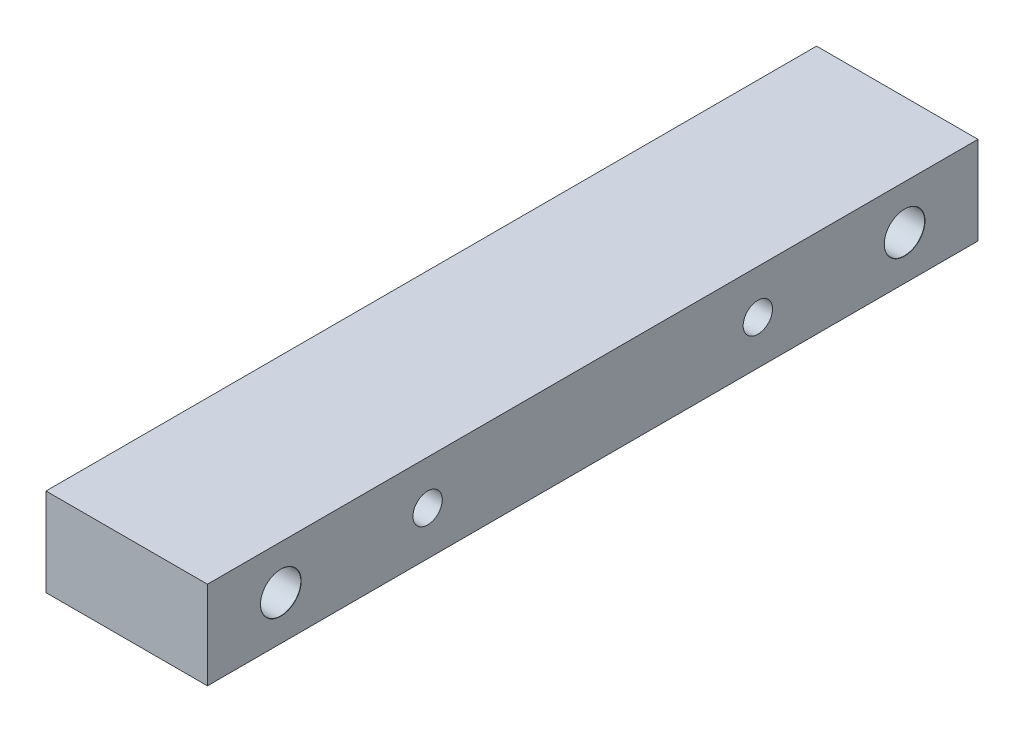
ISO-10303-21;
HEADER;
FILE_DESCRIPTION(('STEP AP214'),'2;1');
FILE_NAME('part.step','',(''),(''),'','','');
FILE_SCHEMA(('AUTOMOTIVE_DESIGN { 1 0 10303 214 1 1 1 1 }'));
ENDSEC;
DATA;
#1=APPLICATION_CONTEXT('core data for automotive mechanical design processes');
#2=APPLICATION_PROTOCOL_DEFINITION('international standard','automotive_design',2000,#1);
#3=PRODUCT_CONTEXT('',#1,'mechanical');
#4=PRODUCT('Part','Part','',(#3));
#5=PRODUCT_RELATED_PRODUCT_CATEGORY('part','',(#4));
#6=PRODUCT_DEFINITION_FORMATION('','',#4);
#7=PRODUCT_DEFINITION_CONTEXT('part definition',#1,'design');
#8=PRODUCT_DEFINITION('design','',#6,#7);
#9=PRODUCT_DEFINITION_SHAPE('','',#8);
#10=(LENGTH_UNIT() NAMED_UNIT(*) SI_UNIT(.MILLI.,.METRE.));
#11=(NAMED_UNIT(*) PLANE_ANGLE_UNIT() SI_UNIT($,.RADIAN.));
#12=(NAMED_UNIT(*) SI_UNIT($,.STERADIAN.) SOLID_ANGLE_UNIT());
#13=UNCERTAINTY_MEASURE_WITH_UNIT(LENGTH_MEASURE(1.E-05),#10,'distance_accuracy_value','');
#14=(GEOMETRIC_REPRESENTATION_CONTEXT(3) GLOBAL_UNCERTAINTY_ASSIGNED_CONTEXT((#13)) GLOBAL_UNIT_ASSIGNED_CONTEXT((#10,
#11,#12)) REPRESENTATION_CONTEXT('',''));
#15=CARTESIAN_POINT('',(0.,0.,0.));
#16=DIRECTION('',(0.,0.,1.));
#17=DIRECTION('',(1.,0.,0.));
#18=AXIS2_PLACEMENT_3D('',#15,#16,#17);
#19=CARTESIAN_POINT('',(-10.,-46.8874741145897,-105.));
#20=DIRECTION('',(1.,0.,0.));
#21=DIRECTION('',(0.,0.,-1.));
#22=AXIS2_PLACEMENT_3D('',#19,#20,#21);
#23=PLANE('',#22);
#24=CARTESIAN_POINT('',(-10.,-40.8874741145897,-30.));
#25=DIRECTION('',(-1.,0.,0.));
#26=DIRECTION('',(0.,0.,1.));
#27=AXIS2_PLACEMENT_3D('',#24,#25,#26);
#28=CIRCLE('',#27,2.);
#29=CARTESIAN_POINT('',(-10.,-40.8874741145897,-28.));
#30=VERTEX_POINT('',#29);
#31=EDGE_CURVE('E177',#30,#30,#28,.T.);
#32=ORIENTED_EDGE('',*,*,#31,.T.);
#33=EDGE_LOOP('',(#32));
#34=FACE_BOUND('',#33,.T.);
#35=CARTESIAN_POINT('',(-10.,-40.8874741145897,-75.));
#36=DIRECTION('',(-1.,0.,0.));
#37=DIRECTION('',(0.,0.,1.));
#38=AXIS2_PLACEMENT_3D('',#35,#36,#37);
#39=CIRCLE('',#38,2.);
#40=CARTESIAN_POINT('',(-10.,-40.8874741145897,-73.));
#41=VERTEX_POINT('',#40);
#42=EDGE_CURVE('E187',#41,#41,#39,.T.);
#43=ORIENTED_EDGE('',*,*,#42,.T.);
#44=EDGE_LOOP('',(#43));
#45=FACE_BOUND('',#44,.T.);
#46=CARTESIAN_POINT('',(-10.,-40.8874741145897,-10.));
#47=DIRECTION('',(-1.,0.,0.));
#48=DIRECTION('',(0.,0.,1.));
#49=AXIS2_PLACEMENT_3D('',#46,#47,#48);
#50=CIRCLE('',#49,2.775);
#51=CARTESIAN_POINT('',(-10.,-40.8874741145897,-7.225));
#52=VERTEX_POINT('',#51);
#53=EDGE_CURVE('E190',#52,#52,#50,.T.);
#54=ORIENTED_EDGE('',*,*,#53,.T.);
#55=EDGE_LOOP('',(#54));
#56=FACE_BOUND('',#55,.T.);
#57=CARTESIAN_POINT('',(-10.,-40.8874741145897,-95.));
#58=DIRECTION('',(-1.,0.,0.));
#59=DIRECTION('',(0.,0.,1.));
#60=AXIS2_PLACEMENT_3D('',#57,#58,#59);
#61=CIRCLE('',#60,2.775);
#62=CARTESIAN_POINT('',(-10.,-40.8874741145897,-92.225));
#63=VERTEX_POINT('',#62);
#64=EDGE_CURVE('E211',#63,#63,#61,.T.);
#65=ORIENTED_EDGE('',*,*,#64,.T.);
#66=EDGE_LOOP('',(#65));
#67=FACE_BOUND('',#66,.T.);
#68=DIRECTION('',(0.,1.,0.));
#69=VECTOR('',#68,1.);
#70=CARTESIAN_POINT('',(-10.,-46.8874741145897,0.));
#71=LINE('',#70,#69);
#72=CARTESIAN_POINT('',(-10.,-46.8874741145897,0.));
#73=VERTEX_POINT('',#72);
#74=CARTESIAN_POINT('',(-10.,-34.8874741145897,0.));
#75=VERTEX_POINT('',#74);
#76=EDGE_CURVE('E81',#73,#75,#71,.T.);
#77=ORIENTED_EDGE('',*,*,#76,.F.);
#78=DIRECTION('',(0.,0.,1.));
#79=VECTOR('',#78,1.);
#80=CARTESIAN_POINT('',(-10.,-46.8874741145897,-105.));
#81=LINE('',#80,#79);
#82=CARTESIAN_POINT('',(-10.,-46.8874741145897,-105.));
#83=VERTEX_POINT('',#82);
#84=EDGE_CURVE('E11',#83,#73,#81,.T.);
#85=ORIENTED_EDGE('',*,*,#84,.F.);
#86=DIRECTION('',(0.,1.,0.));
#87=VECTOR('',#86,1.);
#88=CARTESIAN_POINT('',(-10.,-46.8874741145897,-105.));
#89=LINE('',#88,#87);
#90=CARTESIAN_POINT('',(-10.,-34.8874741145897,-105.));
#91=VERTEX_POINT('',#90);
#92=EDGE_CURVE('E74',#83,#91,#89,.T.);
#93=ORIENTED_EDGE('',*,*,#92,.T.);
#94=DIRECTION('',(0.,0.,1.));
#95=VECTOR('',#94,1.);
#96=CARTESIAN_POINT('',(-10.,-34.8874741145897,-105.));
#97=LINE('',#96,#95);
#98=EDGE_CURVE('E19',#91,#75,#97,.T.);
#99=ORIENTED_EDGE('',*,*,#98,.T.);
#100=EDGE_LOOP('',(#77,#85,#93,#99));
#101=FACE_BOUND('',#100,.T.);
#102=ADVANCED_FACE('F16',(#34,#45,#56,#67,#101),#23,.T.);
#103=CARTESIAN_POINT('',(-10.,-46.8874741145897,-105.));
#104=DIRECTION('',(0.,-1.,0.));
#105=DIRECTION('',(0.,0.,-1.));
#106=AXIS2_PLACEMENT_3D('',#103,#104,#105);
#107=PLANE('',#106);
#108=DIRECTION('',(1.,0.,0.));
#109=VECTOR('',#108,1.);
#110=CARTESIAN_POINT('',(-10.,-46.8874741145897,0.));
#111=LINE('',#110,#109);
#112=CARTESIAN_POINT('',(-32.,-46.8874741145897,0.));
#113=VERTEX_POINT('',#112);
#114=EDGE_CURVE('E76',#113,#73,#111,.T.);
#115=ORIENTED_EDGE('',*,*,#114,.F.);
#116=DIRECTION('',(0.,0.,1.));
#117=VECTOR('',#116,1.);
#118=CARTESIAN_POINT('',(-32.,-46.8874741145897,-105.));
#119=LINE('',#118,#117);
#120=CARTESIAN_POINT('',(-32.,-46.8874741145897,-105.));
#121=VERTEX_POINT('',#120);
#122=EDGE_CURVE('E25',#121,#113,#119,.T.);
#123=ORIENTED_EDGE('',*,*,#122,.F.);
#124=DIRECTION('',(1.,0.,0.));
#125=VECTOR('',#124,1.);
#126=CARTESIAN_POINT('',(-10.,-46.8874741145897,-105.));
#127=LINE('',#126,#125);
#128=EDGE_CURVE('E71',#121,#83,#127,.T.);
#129=ORIENTED_EDGE('',*,*,#128,.T.);
#130=ORIENTED_EDGE('',*,*,#84,.T.);
#131=EDGE_LOOP('',(#115,#123,#129,#130));
#132=FACE_BOUND('',#131,.T.);
#133=ADVANCED_FACE('F92',(#132),#107,.T.);
#134=CARTESIAN_POINT('',(-32.,-46.8874741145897,-105.));
#135=DIRECTION('',(-1.,0.,0.));
#136=DIRECTION('',(0.,0.,1.));
#137=AXIS2_PLACEMENT_3D('',#134,#135,#136);
#138=PLANE('',#137);
#139=CARTESIAN_POINT('',(-32.,-40.8874741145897,-30.));
#140=DIRECTION('',(-1.,0.,0.));
#141=DIRECTION('',(0.,0.,1.));
#142=AXIS2_PLACEMENT_3D('',#139,#140,#141);
#143=CIRCLE('',#142,2.);
#144=CARTESIAN_POINT('',(-32.,-40.8874741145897,-28.));
#145=VERTEX_POINT('',#144);
#146=EDGE_CURVE('E180',#145,#145,#143,.T.);
#147=ORIENTED_EDGE('',*,*,#146,.F.);
#148=EDGE_LOOP('',(#147));
#149=FACE_BOUND('',#148,.T.);
#150=CARTESIAN_POINT('',(-32.,-40.8874741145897,-75.));
#151=DIRECTION('',(-1.,0.,0.));
#152=DIRECTION('',(0.,0.,1.));
#153=AXIS2_PLACEMENT_3D('',#150,#151,#152);
#154=CIRCLE('',#153,2.);
#155=CARTESIAN_POINT('',(-32.,-40.8874741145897,-73.));
#156=VERTEX_POINT('',#155);
#157=EDGE_CURVE('E182',#156,#156,#154,.T.);
#158=ORIENTED_EDGE('',*,*,#157,.F.);
#159=EDGE_LOOP('',(#158));
#160=FACE_BOUND('',#159,.T.);
#161=CARTESIAN_POINT('',(-32.,-40.8874741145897,-10.));
#162=DIRECTION('',(-1.,0.,0.));
#163=DIRECTION('',(0.,0.,1.));
#164=AXIS2_PLACEMENT_3D('',#161,#162,#163);
#165=CIRCLE('',#164,5.025);
#166=CARTESIAN_POINT('',(-32.,-40.8874741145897,-4.975));
#167=VERTEX_POINT('',#166);
#168=EDGE_CURVE('E193',#167,#167,#165,.T.);
#169=ORIENTED_EDGE('',*,*,#168,.F.);
#170=EDGE_LOOP('',(#169));
#171=FACE_BOUND('',#170,.T.);
#172=CARTESIAN_POINT('',(-32.,-40.8874741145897,-95.));
#173=DIRECTION('',(-1.,0.,0.));
#174=DIRECTION('',(0.,0.,1.));
#175=AXIS2_PLACEMENT_3D('',#172,#173,#174);
#176=CIRCLE('',#175,5.025);
#177=CARTESIAN_POINT('',(-32.,-40.8874741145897,-89.975));
#178=VERTEX_POINT('',#177);
#179=EDGE_CURVE('E214',#178,#178,#176,.T.);
#180=ORIENTED_EDGE('',*,*,#179,.F.);
#181=EDGE_LOOP('',(#180));
#182=FACE_BOUND('',#181,.T.);
#183=DIRECTION('',(0.,-1.,0.));
#184=VECTOR('',#183,1.);
#185=CARTESIAN_POINT('',(-32.,-46.8874741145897,0.));
#186=LINE('',#185,#184);
#187=CARTESIAN_POINT('',(-32.,-34.8874741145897,0.));
#188=VERTEX_POINT('',#187);
#189=EDGE_CURVE('E66',#188,#113,#186,.T.);
#190=ORIENTED_EDGE('',*,*,#189,.F.);
#191=DIRECTION('',(0.,0.,1.));
#192=VECTOR('',#191,1.);
#193=CARTESIAN_POINT('',(-32.,-34.8874741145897,-105.));
#194=LINE('',#193,#192);
#195=CARTESIAN_POINT('',(-32.,-34.8874741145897,-105.));
#196=VERTEX_POINT('',#195);
#197=EDGE_CURVE('E61',#196,#188,#194,.T.);
#198=ORIENTED_EDGE('',*,*,#197,.F.);
#199=DIRECTION('',(0.,-1.,0.));
#200=VECTOR('',#199,1.);
#201=CARTESIAN_POINT('',(-32.,-46.8874741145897,-105.));
#202=LINE('',#201,#200);
#203=EDGE_CURVE('E64',#196,#121,#202,.T.);
#204=ORIENTED_EDGE('',*,*,#203,.T.);
#205=ORIENTED_EDGE('',*,*,#122,.T.);
#206=EDGE_LOOP('',(#190,#198,#204,#205));
#207=FACE_BOUND('',#206,.T.);
#208=ADVANCED_FACE('F63',(#149,#160,#171,#182,#207),#138,.T.);
#209=CARTESIAN_POINT('',(-10.,-34.8874741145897,-105.));
#210=DIRECTION('',(0.,1.,0.));
#211=DIRECTION('',(0.,0.,1.));
#212=AXIS2_PLACEMENT_3D('',#209,#210,#211);
#213=PLANE('',#212);
#214=DIRECTION('',(-1.,0.,0.));
#215=VECTOR('',#214,1.);
#216=CARTESIAN_POINT('',(-10.,-34.8874741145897,0.));
#217=LINE('',#216,#215);
#218=EDGE_CURVE('E84',#75,#188,#217,.T.);
#219=ORIENTED_EDGE('',*,*,#218,.F.);
#220=ORIENTED_EDGE('',*,*,#98,.F.);
#221=DIRECTION('',(-1.,0.,0.));
#222=VECTOR('',#221,1.);
#223=CARTESIAN_POINT('',(-10.,-34.8874741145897,-105.));
#224=LINE('',#223,#222);
#225=EDGE_CURVE('E70',#91,#196,#224,.T.);
#226=ORIENTED_EDGE('',*,*,#225,.T.);
#227=ORIENTED_EDGE('',*,*,#197,.T.);
#228=EDGE_LOOP('',(#219,#220,#226,#227));
#229=FACE_BOUND('',#228,.T.);
#230=ADVANCED_FACE('F73',(#229),#213,.T.);
#231=CARTESIAN_POINT('',(0.,0.,-105.));
#232=DIRECTION('',(0.,0.,1.));
#233=DIRECTION('',(1.,0.,0.));
#234=AXIS2_PLACEMENT_3D('',#231,#232,#233);
#235=PLANE('',#234);
#236=ORIENTED_EDGE('',*,*,#92,.F.);
#237=ORIENTED_EDGE('',*,*,#128,.F.);
#238=ORIENTED_EDGE('',*,*,#203,.F.);
#239=ORIENTED_EDGE('',*,*,#225,.F.);
#240=EDGE_LOOP('',(#236,#237,#238,#239));
#241=FACE_BOUND('',#240,.T.);
#242=ADVANCED_FACE('F69',(#241),#235,.F.);
#243=CARTESIAN_POINT('',(0.,0.,0.));
#244=DIRECTION('',(0.,0.,1.));
#245=DIRECTION('',(1.,0.,0.));
#246=AXIS2_PLACEMENT_3D('',#243,#244,#245);
#247=PLANE('',#246);
#248=ORIENTED_EDGE('',*,*,#76,.T.);
#249=ORIENTED_EDGE('',*,*,#218,.T.);
#250=ORIENTED_EDGE('',*,*,#189,.T.);
#251=ORIENTED_EDGE('',*,*,#114,.T.);
#252=EDGE_LOOP('',(#248,#249,#250,#251));
#253=FACE_BOUND('',#252,.T.);
#254=ADVANCED_FACE('F91',(#253),#247,.T.);
#255=CARTESIAN_POINT('',(-10.025,-40.8874741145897,-95.));
#256=DIRECTION('',(1.,0.,0.));
#257=DIRECTION('',(0.,0.,-1.));
#258=AXIS2_PLACEMENT_3D('',#255,#256,#257);
#259=CONICAL_SURFACE('',#258,2.75,0.785398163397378);
#260=ORIENTED_EDGE('',*,*,#64,.F.);
#261=EDGE_LOOP('',(#260));
#262=FACE_BOUND('',#261,.T.);
#263=CARTESIAN_POINT('',(-10.025,-40.8874741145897,-95.));
#264=DIRECTION('',(-1.,0.,0.));
#265=DIRECTION('',(0.,0.,1.));
#266=AXIS2_PLACEMENT_3D('',#263,#264,#265);
#267=CIRCLE('',#266,2.75);
#268=CARTESIAN_POINT('',(-10.025,-40.8874741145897,-92.25));
#269=VERTEX_POINT('',#268);
#270=EDGE_CURVE('E85',#269,#269,#267,.T.);
#271=ORIENTED_EDGE('',*,*,#270,.T.);
#272=EDGE_LOOP('',(#271));
#273=FACE_BOUND('',#272,.T.);
#274=ADVANCED_FACE('F115',(#262,#273),#259,.F.);
#275=CARTESIAN_POINT('',(-32.,-40.8874741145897,-95.));
#276=DIRECTION('',(-1.,0.,0.));
#277=DIRECTION('',(0.,0.,1.));
#278=AXIS2_PLACEMENT_3D('',#275,#276,#277);
#279=CYLINDRICAL_SURFACE('',#278,2.75);
#280=ORIENTED_EDGE('',*,*,#270,.F.);
#281=EDGE_LOOP('',(#280));
#282=FACE_BOUND('',#281,.T.);
#283=CARTESIAN_POINT('',(-26.275,-40.8874741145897,-95.));
#284=DIRECTION('',(-1.,0.,0.));
#285=DIRECTION('',(0.,0.,1.));
#286=AXIS2_PLACEMENT_3D('',#283,#284,#285);
#287=CIRCLE('',#286,2.75);
#288=CARTESIAN_POINT('',(-26.275,-40.8874741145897,-92.25));
#289=VERTEX_POINT('',#288);
#290=EDGE_CURVE('E226',#289,#289,#287,.T.);
#291=ORIENTED_EDGE('',*,*,#290,.T.);
#292=EDGE_LOOP('',(#291));
#293=FACE_BOUND('',#292,.T.);
#294=ADVANCED_FACE('F119',(#282,#293),#279,.F.);
#295=CARTESIAN_POINT('',(-26.3,-40.8874741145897,-95.));
#296=DIRECTION('',(-1.,0.,0.));
#297=DIRECTION('',(0.,0.,1.));
#298=AXIS2_PLACEMENT_3D('',#295,#296,#297);
#299=CONICAL_SURFACE('',#298,2.775,0.785398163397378);
#300=ORIENTED_EDGE('',*,*,#290,.F.);
#301=EDGE_LOOP('',(#300));
#302=FACE_BOUND('',#301,.T.);
#303=CARTESIAN_POINT('',(-26.3,-40.8874741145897,-95.));
#304=DIRECTION('',(-1.,0.,0.));
#305=DIRECTION('',(0.,0.,1.));
#306=AXIS2_PLACEMENT_3D('',#303,#304,#305);
#307=CIRCLE('',#306,2.775);
#308=CARTESIAN_POINT('',(-26.3,-40.8874741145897,-92.225));
#309=VERTEX_POINT('',#308);
#310=EDGE_CURVE('E223',#309,#309,#307,.T.);
#311=ORIENTED_EDGE('',*,*,#310,.T.);
#312=EDGE_LOOP('',(#311));
#313=FACE_BOUND('',#312,.T.);
#314=ADVANCED_FACE('F123',(#302,#313),#299,.F.);
#315=CARTESIAN_POINT('',(-26.3,-38.1124741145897,-95.));
#316=DIRECTION('',(1.,0.,0.));
#317=DIRECTION('',(0.,0.,-1.));
#318=AXIS2_PLACEMENT_3D('',#315,#316,#317);
#319=PLANE('',#318);
#320=ORIENTED_EDGE('',*,*,#310,.F.);
#321=EDGE_LOOP('',(#320));
#322=FACE_BOUND('',#321,.T.);
#323=CARTESIAN_POINT('',(-26.3,-40.8874741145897,-95.));
#324=DIRECTION('',(-1.,0.,0.));
#325=DIRECTION('',(0.,0.,1.));
#326=AXIS2_PLACEMENT_3D('',#323,#324,#325);
#327=CIRCLE('',#326,5.);
#328=CARTESIAN_POINT('',(-26.3,-40.8874741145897,-90.));
#329=VERTEX_POINT('',#328);
#330=EDGE_CURVE('E220',#329,#329,#327,.T.);
#331=ORIENTED_EDGE('',*,*,#330,.T.);
#332=EDGE_LOOP('',(#331));
#333=FACE_BOUND('',#332,.T.);
#334=ADVANCED_FACE('F127',(#322,#333),#319,.F.);
#335=CARTESIAN_POINT('',(-32.,-40.8874741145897,-95.));
#336=DIRECTION('',(-1.,0.,0.));
#337=DIRECTION('',(0.,0.,1.));
#338=AXIS2_PLACEMENT_3D('',#335,#336,#337);
#339=CYLINDRICAL_SURFACE('',#338,5.);
#340=ORIENTED_EDGE('',*,*,#330,.F.);
#341=EDGE_LOOP('',(#340));
#342=FACE_BOUND('',#341,.T.);
#343=CARTESIAN_POINT('',(-31.975,-40.8874741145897,-95.));
#344=DIRECTION('',(-1.,0.,0.));
#345=DIRECTION('',(0.,0.,1.));
#346=AXIS2_PLACEMENT_3D('',#343,#344,#345);
#347=CIRCLE('',#346,5.);
#348=CARTESIAN_POINT('',(-31.975,-40.8874741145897,-90.));
#349=VERTEX_POINT('',#348);
#350=EDGE_CURVE('E217',#349,#349,#347,.T.);
#351=ORIENTED_EDGE('',*,*,#350,.T.);
#352=EDGE_LOOP('',(#351));
#353=FACE_BOUND('',#352,.T.);
#354=ADVANCED_FACE('F131',(#342,#353),#339,.F.);
#355=CARTESIAN_POINT('',(-32.,-40.8874741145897,-95.));
#356=DIRECTION('',(-1.,0.,0.));
#357=DIRECTION('',(0.,0.,1.));
#358=AXIS2_PLACEMENT_3D('',#355,#356,#357);
#359=CONICAL_SURFACE('',#358,5.025,0.785398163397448);
#360=ORIENTED_EDGE('',*,*,#350,.F.);
#361=EDGE_LOOP('',(#360));
#362=FACE_BOUND('',#361,.T.);
#363=ORIENTED_EDGE('',*,*,#179,.T.);
#364=EDGE_LOOP('',(#363));
#365=FACE_BOUND('',#364,.T.);
#366=ADVANCED_FACE('F135',(#362,#365),#359,.F.);
#367=CARTESIAN_POINT('',(-10.025,-40.8874741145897,-10.));
#368=DIRECTION('',(1.,0.,0.));
#369=DIRECTION('',(0.,0.,-1.));
#370=AXIS2_PLACEMENT_3D('',#367,#368,#369);
#371=CONICAL_SURFACE('',#370,2.75,0.785398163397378);
#372=ORIENTED_EDGE('',*,*,#53,.F.);
#373=EDGE_LOOP('',(#372));
#374=FACE_BOUND('',#373,.T.);
#375=CARTESIAN_POINT('',(-10.025,-40.8874741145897,-10.));
#376=DIRECTION('',(-1.,0.,0.));
#377=DIRECTION('',(0.,0.,1.));
#378=AXIS2_PLACEMENT_3D('',#375,#376,#377);
#379=CIRCLE('',#378,2.75);
#380=CARTESIAN_POINT('',(-10.025,-40.8874741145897,-7.25));
#381=VERTEX_POINT('',#380);
#382=EDGE_CURVE('E208',#381,#381,#379,.T.);
#383=ORIENTED_EDGE('',*,*,#382,.T.);
#384=EDGE_LOOP('',(#383));
#385=FACE_BOUND('',#384,.T.);
#386=ADVANCED_FACE('F139',(#374,#385),#371,.F.);
#387=CARTESIAN_POINT('',(-32.,-40.8874741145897,-10.));
#388=DIRECTION('',(-1.,0.,0.));
#389=DIRECTION('',(0.,0.,1.));
#390=AXIS2_PLACEMENT_3D('',#387,#388,#389);
#391=CYLINDRICAL_SURFACE('',#390,2.75);
#392=ORIENTED_EDGE('',*,*,#382,.F.);
#393=EDGE_LOOP('',(#392));
#394=FACE_BOUND('',#393,.T.);
#395=CARTESIAN_POINT('',(-26.275,-40.8874741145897,-10.));
#396=DIRECTION('',(-1.,0.,0.));
#397=DIRECTION('',(0.,0.,1.));
#398=AXIS2_PLACEMENT_3D('',#395,#396,#397);
#399=CIRCLE('',#398,2.75);
#400=CARTESIAN_POINT('',(-26.275,-40.8874741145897,-7.25));
#401=VERTEX_POINT('',#400);
#402=EDGE_CURVE('E205',#401,#401,#399,.T.);
#403=ORIENTED_EDGE('',*,*,#402,.T.);
#404=EDGE_LOOP('',(#403));
#405=FACE_BOUND('',#404,.T.);
#406=ADVANCED_FACE('F143',(#394,#405),#391,.F.);
#407=CARTESIAN_POINT('',(-26.3,-40.8874741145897,-10.));
#408=DIRECTION('',(-1.,0.,0.));
#409=DIRECTION('',(0.,0.,1.));
#410=AXIS2_PLACEMENT_3D('',#407,#408,#409);
#411=CONICAL_SURFACE('',#410,2.775,0.785398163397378);
#412=ORIENTED_EDGE('',*,*,#402,.F.);
#413=EDGE_LOOP('',(#412));
#414=FACE_BOUND('',#413,.T.);
#415=CARTESIAN_POINT('',(-26.3,-40.8874741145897,-10.));
#416=DIRECTION('',(-1.,0.,0.));
#417=DIRECTION('',(0.,0.,1.));
#418=AXIS2_PLACEMENT_3D('',#415,#416,#417);
#419=CIRCLE('',#418,2.775);
#420=CARTESIAN_POINT('',(-26.3,-40.8874741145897,-7.225));
#421=VERTEX_POINT('',#420);
#422=EDGE_CURVE('E202',#421,#421,#419,.T.);
#423=ORIENTED_EDGE('',*,*,#422,.T.);
#424=EDGE_LOOP('',(#423));
#425=FACE_BOUND('',#424,.T.);
#426=ADVANCED_FACE('F147',(#414,#425),#411,.F.);
#427=CARTESIAN_POINT('',(-26.3,-38.1124741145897,-10.));
#428=DIRECTION('',(1.,0.,0.));
#429=DIRECTION('',(0.,0.,-1.));
#430=AXIS2_PLACEMENT_3D('',#427,#428,#429);
#431=PLANE('',#430);
#432=ORIENTED_EDGE('',*,*,#422,.F.);
#433=EDGE_LOOP('',(#432));
#434=FACE_BOUND('',#433,.T.);
#435=CARTESIAN_POINT('',(-26.3,-40.8874741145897,-10.));
#436=DIRECTION('',(-1.,0.,0.));
#437=DIRECTION('',(0.,0.,1.));
#438=AXIS2_PLACEMENT_3D('',#435,#436,#437);
#439=CIRCLE('',#438,5.);
#440=CARTESIAN_POINT('',(-26.3,-40.8874741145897,-5.));
#441=VERTEX_POINT('',#440);
#442=EDGE_CURVE('E199',#441,#441,#439,.T.);
#443=ORIENTED_EDGE('',*,*,#442,.T.);
#444=EDGE_LOOP('',(#443));
#445=FACE_BOUND('',#444,.T.);
#446=ADVANCED_FACE('F151',(#434,#445),#431,.F.);
#447=CARTESIAN_POINT('',(-32.,-40.8874741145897,-10.));
#448=DIRECTION('',(-1.,0.,0.));
#449=DIRECTION('',(0.,0.,1.));
#450=AXIS2_PLACEMENT_3D('',#447,#448,#449);
#451=CYLINDRICAL_SURFACE('',#450,5.);
#452=ORIENTED_EDGE('',*,*,#442,.F.);
#453=EDGE_LOOP('',(#452));
#454=FACE_BOUND('',#453,.T.);
#455=CARTESIAN_POINT('',(-31.975,-40.8874741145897,-10.));
#456=DIRECTION('',(-1.,0.,0.));
#457=DIRECTION('',(0.,0.,1.));
#458=AXIS2_PLACEMENT_3D('',#455,#456,#457);
#459=CIRCLE('',#458,5.);
#460=CARTESIAN_POINT('',(-31.975,-40.8874741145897,-5.));
#461=VERTEX_POINT('',#460);
#462=EDGE_CURVE('E196',#461,#461,#459,.T.);
#463=ORIENTED_EDGE('',*,*,#462,.T.);
#464=EDGE_LOOP('',(#463));
#465=FACE_BOUND('',#464,.T.);
#466=ADVANCED_FACE('F155',(#454,#465),#451,.F.);
#467=CARTESIAN_POINT('',(-32.,-40.8874741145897,-10.));
#468=DIRECTION('',(-1.,0.,0.));
#469=DIRECTION('',(0.,0.,1.));
#470=AXIS2_PLACEMENT_3D('',#467,#468,#469);
#471=CONICAL_SURFACE('',#470,5.025,0.785398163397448);
#472=ORIENTED_EDGE('',*,*,#462,.F.);
#473=EDGE_LOOP('',(#472));
#474=FACE_BOUND('',#473,.T.);
#475=ORIENTED_EDGE('',*,*,#168,.T.);
#476=EDGE_LOOP('',(#475));
#477=FACE_BOUND('',#476,.T.);
#478=ADVANCED_FACE('F159',(#474,#477),#471,.F.);
#479=CARTESIAN_POINT('',(-32.,-40.8874741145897,-75.));
#480=DIRECTION('',(-1.,0.,0.));
#481=DIRECTION('',(0.,0.,1.));
#482=AXIS2_PLACEMENT_3D('',#479,#480,#481);
#483=CYLINDRICAL_SURFACE('',#482,2.);
#484=ORIENTED_EDGE('',*,*,#42,.F.);
#485=EDGE_LOOP('',(#484));
#486=FACE_BOUND('',#485,.T.);
#487=ORIENTED_EDGE('',*,*,#157,.T.);
#488=EDGE_LOOP('',(#487));
#489=FACE_BOUND('',#488,.T.);
#490=ADVANCED_FACE('F163',(#486,#489),#483,.F.);
#491=CARTESIAN_POINT('',(-32.,-40.8874741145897,-30.));
#492=DIRECTION('',(-1.,0.,0.));
#493=DIRECTION('',(0.,0.,1.));
#494=AXIS2_PLACEMENT_3D('',#491,#492,#493);
#495=CYLINDRICAL_SURFACE('',#494,2.);
#496=ORIENTED_EDGE('',*,*,#31,.F.);
#497=EDGE_LOOP('',(#496));
#498=FACE_BOUND('',#497,.T.);
#499=ORIENTED_EDGE('',*,*,#146,.T.);
#500=EDGE_LOOP('',(#499));
#501=FACE_BOUND('',#500,.T.);
#502=ADVANCED_FACE('F167',(#498,#501),#495,.F.);
#503=CLOSED_SHELL('',(#102,#133,#208,#230,#242,#254,#274,#294,#314,#334,#354,#366,#386,#406,
#426,#446,#466,#478,#490,#502));
#504=MANIFOLD_SOLID_BREP('B1',#503);
#505=ADVANCED_BREP_SHAPE_REPRESENTATION('',(#18,#504),#14);
#506=SHAPE_DEFINITION_REPRESENTATION(#9,#505);
ENDSEC;
END-ISO-10303-21;
